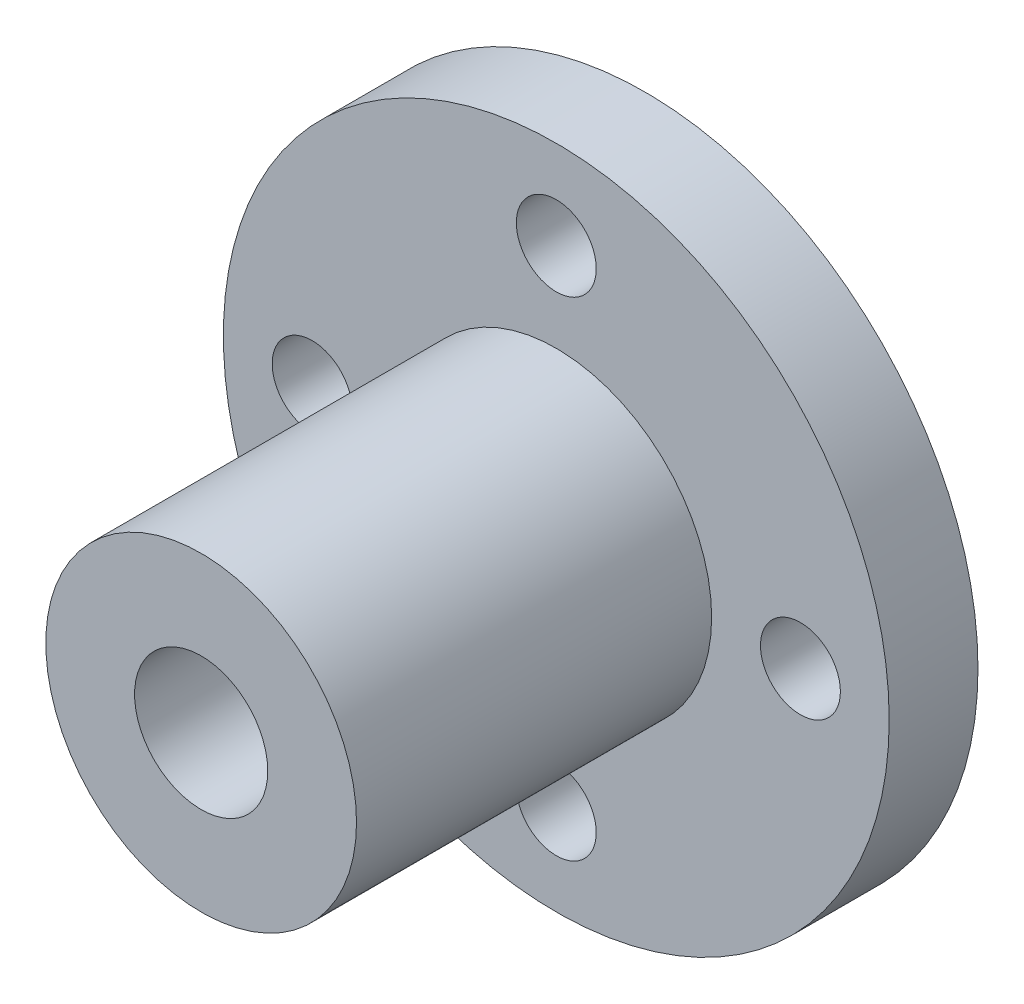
ISO-10303-21;
HEADER;
FILE_DESCRIPTION(('STEP AP214'),'2;1');
FILE_NAME('part.step','',(''),(''),'','','');
FILE_SCHEMA(('AUTOMOTIVE_DESIGN { 1 0 10303 214 1 1 1 1 }'));
ENDSEC;
DATA;
#1=APPLICATION_CONTEXT('core data for automotive mechanical design processes');
#2=APPLICATION_PROTOCOL_DEFINITION('international standard','automotive_design',2000,#1);
#3=PRODUCT_CONTEXT('',#1,'mechanical');
#4=PRODUCT('Part','Part','',(#3));
#5=PRODUCT_RELATED_PRODUCT_CATEGORY('part','',(#4));
#6=PRODUCT_DEFINITION_FORMATION('','',#4);
#7=PRODUCT_DEFINITION_CONTEXT('part definition',#1,'design');
#8=PRODUCT_DEFINITION('design','',#6,#7);
#9=PRODUCT_DEFINITION_SHAPE('','',#8);
#10=(LENGTH_UNIT() NAMED_UNIT(*) SI_UNIT(.MILLI.,.METRE.));
#11=(NAMED_UNIT(*) PLANE_ANGLE_UNIT() SI_UNIT($,.RADIAN.));
#12=(NAMED_UNIT(*) SI_UNIT($,.STERADIAN.) SOLID_ANGLE_UNIT());
#13=UNCERTAINTY_MEASURE_WITH_UNIT(LENGTH_MEASURE(1.E-05),#10,'distance_accuracy_value','');
#14=(GEOMETRIC_REPRESENTATION_CONTEXT(3) GLOBAL_UNCERTAINTY_ASSIGNED_CONTEXT((#13)) GLOBAL_UNIT_ASSIGNED_CONTEXT((#10,
#11,#12)) REPRESENTATION_CONTEXT('',''));
#15=CARTESIAN_POINT('',(0.,0.,0.));
#16=DIRECTION('',(0.,0.,1.));
#17=DIRECTION('',(1.,0.,0.));
#18=AXIS2_PLACEMENT_3D('',#15,#16,#17);
#19=CARTESIAN_POINT('',(0.,37.5,-50.));
#20=DIRECTION('',(0.,0.,1.));
#21=DIRECTION('',(1.,0.,0.));
#22=AXIS2_PLACEMENT_3D('',#19,#20,#21);
#23=PLANE('',#22);
#24=CARTESIAN_POINT('',(-27.5,2.88047377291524E-13,-50.));
#25=DIRECTION('',(0.,0.,1.));
#26=DIRECTION('',(1.,0.,0.));
#27=AXIS2_PLACEMENT_3D('',#24,#25,#26);
#28=CIRCLE('',#27,4.5);
#29=CARTESIAN_POINT('',(-23.,2.88047377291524E-13,-50.));
#30=VERTEX_POINT('',#29);
#31=EDGE_CURVE('E75',#30,#30,#28,.T.);
#32=ORIENTED_EDGE('',*,*,#31,.T.);
#33=EDGE_LOOP('',(#32));
#34=FACE_BOUND('',#33,.T.);
#35=CARTESIAN_POINT('',(-1.92031584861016E-13,-27.5,-50.));
#36=DIRECTION('',(0.,0.,1.));
#37=DIRECTION('',(1.,0.,0.));
#38=AXIS2_PLACEMENT_3D('',#35,#36,#37);
#39=CIRCLE('',#38,4.5);
#40=CARTESIAN_POINT('',(4.4999999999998,-27.5,-50.));
#41=VERTEX_POINT('',#40);
#42=EDGE_CURVE('E69',#41,#41,#39,.T.);
#43=ORIENTED_EDGE('',*,*,#42,.T.);
#44=EDGE_LOOP('',(#43));
#45=FACE_BOUND('',#44,.T.);
#46=CARTESIAN_POINT('',(27.5,0.,-50.));
#47=DIRECTION('',(0.,0.,1.));
#48=DIRECTION('',(1.,0.,0.));
#49=AXIS2_PLACEMENT_3D('',#46,#47,#48);
#50=CIRCLE('',#49,4.49999999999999);
#51=CARTESIAN_POINT('',(32.,0.,-50.));
#52=VERTEX_POINT('',#51);
#53=EDGE_CURVE('E63',#52,#52,#50,.T.);
#54=ORIENTED_EDGE('',*,*,#53,.T.);
#55=EDGE_LOOP('',(#54));
#56=FACE_BOUND('',#55,.T.);
#57=CARTESIAN_POINT('',(0.,27.5,-50.));
#58=DIRECTION('',(0.,0.,1.));
#59=DIRECTION('',(1.,0.,0.));
#60=AXIS2_PLACEMENT_3D('',#57,#58,#59);
#61=CIRCLE('',#60,4.5);
#62=CARTESIAN_POINT('',(4.5,27.5,-50.));
#63=VERTEX_POINT('',#62);
#64=EDGE_CURVE('E57',#63,#63,#61,.T.);
#65=ORIENTED_EDGE('',*,*,#64,.T.);
#66=EDGE_LOOP('',(#65));
#67=FACE_BOUND('',#66,.T.);
#68=CARTESIAN_POINT('',(0.,0.,-50.));
#69=DIRECTION('',(0.,0.,1.));
#70=DIRECTION('',(1.,0.,0.));
#71=AXIS2_PLACEMENT_3D('',#68,#69,#70);
#72=CIRCLE('',#71,37.5);
#73=CARTESIAN_POINT('',(37.5,0.,-50.));
#74=VERTEX_POINT('',#73);
#75=EDGE_CURVE('E54',#74,#74,#72,.T.);
#76=ORIENTED_EDGE('',*,*,#75,.F.);
#77=EDGE_LOOP('',(#76));
#78=FACE_BOUND('',#77,.T.);
#79=CARTESIAN_POINT('',(0.,0.,-50.));
#80=DIRECTION('',(0.,0.,1.));
#81=DIRECTION('',(1.,0.,0.));
#82=AXIS2_PLACEMENT_3D('',#79,#80,#81);
#83=CIRCLE('',#82,7.5);
#84=CARTESIAN_POINT('',(7.5,0.,-50.));
#85=VERTEX_POINT('',#84);
#86=EDGE_CURVE('E10',#85,#85,#83,.T.);
#87=ORIENTED_EDGE('',*,*,#86,.T.);
#88=EDGE_LOOP('',(#87));
#89=FACE_BOUND('',#88,.T.);
#90=ADVANCED_FACE('F32',(#34,#45,#56,#67,#78,#89),#23,.F.);
#91=CARTESIAN_POINT('',(0.,0.,0.));
#92=DIRECTION('',(0.,0.,1.));
#93=DIRECTION('',(1.,0.,0.));
#94=AXIS2_PLACEMENT_3D('',#91,#92,#93);
#95=CYLINDRICAL_SURFACE('',#94,7.5);
#96=ORIENTED_EDGE('',*,*,#86,.F.);
#97=EDGE_LOOP('',(#96));
#98=FACE_BOUND('',#97,.T.);
#99=CARTESIAN_POINT('',(0.,0.,0.));
#100=DIRECTION('',(0.,0.,1.));
#101=DIRECTION('',(1.,0.,0.));
#102=AXIS2_PLACEMENT_3D('',#99,#100,#101);
#103=CIRCLE('',#102,7.49999999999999);
#104=CARTESIAN_POINT('',(7.49999999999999,0.,0.));
#105=VERTEX_POINT('',#104);
#106=EDGE_CURVE('E38',#105,#105,#103,.T.);
#107=ORIENTED_EDGE('',*,*,#106,.T.);
#108=EDGE_LOOP('',(#107));
#109=FACE_BOUND('',#108,.T.);
#110=ADVANCED_FACE('F108',(#98,#109),#95,.F.);
#111=CARTESIAN_POINT('',(0.,7.49999999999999,0.));
#112=DIRECTION('',(0.,0.,-1.));
#113=DIRECTION('',(-1.,0.,0.));
#114=AXIS2_PLACEMENT_3D('',#111,#112,#113);
#115=PLANE('',#114);
#116=ORIENTED_EDGE('',*,*,#106,.F.);
#117=EDGE_LOOP('',(#116));
#118=FACE_BOUND('',#117,.T.);
#119=CARTESIAN_POINT('',(0.,0.,0.));
#120=DIRECTION('',(0.,0.,1.));
#121=DIRECTION('',(1.,0.,0.));
#122=AXIS2_PLACEMENT_3D('',#119,#120,#121);
#123=CIRCLE('',#122,17.5);
#124=CARTESIAN_POINT('',(17.5,0.,0.));
#125=VERTEX_POINT('',#124);
#126=EDGE_CURVE('E42',#125,#125,#123,.T.);
#127=ORIENTED_EDGE('',*,*,#126,.T.);
#128=EDGE_LOOP('',(#127));
#129=FACE_BOUND('',#128,.T.);
#130=ADVANCED_FACE('F113',(#118,#129),#115,.F.);
#131=CARTESIAN_POINT('',(0.,0.,0.));
#132=DIRECTION('',(0.,0.,1.));
#133=DIRECTION('',(1.,0.,0.));
#134=AXIS2_PLACEMENT_3D('',#131,#132,#133);
#135=CYLINDRICAL_SURFACE('',#134,17.5);
#136=ORIENTED_EDGE('',*,*,#126,.F.);
#137=EDGE_LOOP('',(#136));
#138=FACE_BOUND('',#137,.T.);
#139=CARTESIAN_POINT('',(0.,0.,-40.));
#140=DIRECTION('',(0.,0.,1.));
#141=DIRECTION('',(1.,0.,0.));
#142=AXIS2_PLACEMENT_3D('',#139,#140,#141);
#143=CIRCLE('',#142,17.5);
#144=CARTESIAN_POINT('',(17.5,0.,-40.));
#145=VERTEX_POINT('',#144);
#146=EDGE_CURVE('E46',#145,#145,#143,.T.);
#147=ORIENTED_EDGE('',*,*,#146,.T.);
#148=EDGE_LOOP('',(#147));
#149=FACE_BOUND('',#148,.T.);
#150=ADVANCED_FACE('F89',(#138,#149),#135,.T.);
#151=CARTESIAN_POINT('',(0.,17.5,-40.));
#152=DIRECTION('',(0.,0.,-1.));
#153=DIRECTION('',(-1.,0.,0.));
#154=AXIS2_PLACEMENT_3D('',#151,#152,#153);
#155=PLANE('',#154);
#156=CARTESIAN_POINT('',(-27.5,2.88047377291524E-13,-40.));
#157=DIRECTION('',(0.,0.,1.));
#158=DIRECTION('',(1.,0.,0.));
#159=AXIS2_PLACEMENT_3D('',#156,#157,#158);
#160=CIRCLE('',#159,4.5);
#161=CARTESIAN_POINT('',(-23.,2.88047377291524E-13,-40.));
#162=VERTEX_POINT('',#161);
#163=EDGE_CURVE('E78',#162,#162,#160,.T.);
#164=ORIENTED_EDGE('',*,*,#163,.F.);
#165=EDGE_LOOP('',(#164));
#166=FACE_BOUND('',#165,.T.);
#167=CARTESIAN_POINT('',(-1.92031584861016E-13,-27.5,-40.));
#168=DIRECTION('',(0.,0.,1.));
#169=DIRECTION('',(1.,0.,0.));
#170=AXIS2_PLACEMENT_3D('',#167,#168,#169);
#171=CIRCLE('',#170,4.5);
#172=CARTESIAN_POINT('',(4.4999999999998,-27.5,-40.));
#173=VERTEX_POINT('',#172);
#174=EDGE_CURVE('E72',#173,#173,#171,.T.);
#175=ORIENTED_EDGE('',*,*,#174,.F.);
#176=EDGE_LOOP('',(#175));
#177=FACE_BOUND('',#176,.T.);
#178=CARTESIAN_POINT('',(27.5,0.,-40.));
#179=DIRECTION('',(0.,0.,1.));
#180=DIRECTION('',(1.,0.,0.));
#181=AXIS2_PLACEMENT_3D('',#178,#179,#180);
#182=CIRCLE('',#181,4.5);
#183=CARTESIAN_POINT('',(32.,0.,-40.));
#184=VERTEX_POINT('',#183);
#185=EDGE_CURVE('E66',#184,#184,#182,.T.);
#186=ORIENTED_EDGE('',*,*,#185,.F.);
#187=EDGE_LOOP('',(#186));
#188=FACE_BOUND('',#187,.T.);
#189=CARTESIAN_POINT('',(0.,27.5,-40.));
#190=DIRECTION('',(0.,0.,1.));
#191=DIRECTION('',(1.,0.,0.));
#192=AXIS2_PLACEMENT_3D('',#189,#190,#191);
#193=CIRCLE('',#192,4.5);
#194=CARTESIAN_POINT('',(4.5,27.5,-40.));
#195=VERTEX_POINT('',#194);
#196=EDGE_CURVE('E60',#195,#195,#193,.T.);
#197=ORIENTED_EDGE('',*,*,#196,.F.);
#198=EDGE_LOOP('',(#197));
#199=FACE_BOUND('',#198,.T.);
#200=ORIENTED_EDGE('',*,*,#146,.F.);
#201=EDGE_LOOP('',(#200));
#202=FACE_BOUND('',#201,.T.);
#203=CARTESIAN_POINT('',(0.,0.,-40.));
#204=DIRECTION('',(0.,0.,1.));
#205=DIRECTION('',(1.,0.,0.));
#206=AXIS2_PLACEMENT_3D('',#203,#204,#205);
#207=CIRCLE('',#206,37.5);
#208=CARTESIAN_POINT('',(37.5,0.,-40.));
#209=VERTEX_POINT('',#208);
#210=EDGE_CURVE('E51',#209,#209,#207,.T.);
#211=ORIENTED_EDGE('',*,*,#210,.T.);
#212=EDGE_LOOP('',(#211));
#213=FACE_BOUND('',#212,.T.);
#214=ADVANCED_FACE('F85',(#166,#177,#188,#199,#202,#213),#155,.F.);
#215=CARTESIAN_POINT('',(0.,0.,0.));
#216=DIRECTION('',(0.,0.,1.));
#217=DIRECTION('',(1.,0.,0.));
#218=AXIS2_PLACEMENT_3D('',#215,#216,#217);
#219=CYLINDRICAL_SURFACE('',#218,37.5);
#220=ORIENTED_EDGE('',*,*,#210,.F.);
#221=EDGE_LOOP('',(#220));
#222=FACE_BOUND('',#221,.T.);
#223=ORIENTED_EDGE('',*,*,#75,.T.);
#224=EDGE_LOOP('',(#223));
#225=FACE_BOUND('',#224,.T.);
#226=ADVANCED_FACE('F88',(#222,#225),#219,.T.);
#227=CARTESIAN_POINT('',(0.,27.5,-40.));
#228=DIRECTION('',(0.,0.,1.));
#229=DIRECTION('',(1.,0.,0.));
#230=AXIS2_PLACEMENT_3D('',#227,#228,#229);
#231=CYLINDRICAL_SURFACE('',#230,4.5);
#232=ORIENTED_EDGE('',*,*,#196,.T.);
#233=EDGE_LOOP('',(#232));
#234=FACE_BOUND('',#233,.T.);
#235=ORIENTED_EDGE('',*,*,#64,.F.);
#236=EDGE_LOOP('',(#235));
#237=FACE_BOUND('',#236,.T.);
#238=ADVANCED_FACE('F103',(#234,#237),#231,.F.);
#239=CARTESIAN_POINT('',(27.5,0.,-40.));
#240=DIRECTION('',(0.,0.,1.));
#241=DIRECTION('',(1.,0.,0.));
#242=AXIS2_PLACEMENT_3D('',#239,#240,#241);
#243=CYLINDRICAL_SURFACE('',#242,4.49999999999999);
#244=ORIENTED_EDGE('',*,*,#185,.T.);
#245=EDGE_LOOP('',(#244));
#246=FACE_BOUND('',#245,.T.);
#247=ORIENTED_EDGE('',*,*,#53,.F.);
#248=EDGE_LOOP('',(#247));
#249=FACE_BOUND('',#248,.T.);
#250=ADVANCED_FACE('F124',(#246,#249),#243,.F.);
#251=CARTESIAN_POINT('',(-1.92031584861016E-13,-27.5,-40.));
#252=DIRECTION('',(0.,0.,1.));
#253=DIRECTION('',(1.,0.,0.));
#254=AXIS2_PLACEMENT_3D('',#251,#252,#253);
#255=CYLINDRICAL_SURFACE('',#254,4.5);
#256=ORIENTED_EDGE('',*,*,#174,.T.);
#257=EDGE_LOOP('',(#256));
#258=FACE_BOUND('',#257,.T.);
#259=ORIENTED_EDGE('',*,*,#42,.F.);
#260=EDGE_LOOP('',(#259));
#261=FACE_BOUND('',#260,.T.);
#262=ADVANCED_FACE('F130',(#258,#261),#255,.F.);
#263=CARTESIAN_POINT('',(-27.5,2.88047377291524E-13,-40.));
#264=DIRECTION('',(0.,0.,1.));
#265=DIRECTION('',(1.,0.,0.));
#266=AXIS2_PLACEMENT_3D('',#263,#264,#265);
#267=CYLINDRICAL_SURFACE('',#266,4.5);
#268=ORIENTED_EDGE('',*,*,#163,.T.);
#269=EDGE_LOOP('',(#268));
#270=FACE_BOUND('',#269,.T.);
#271=ORIENTED_EDGE('',*,*,#31,.F.);
#272=EDGE_LOOP('',(#271));
#273=FACE_BOUND('',#272,.T.);
#274=ADVANCED_FACE('F82',(#270,#273),#267,.F.);
#275=CLOSED_SHELL('',(#90,#110,#130,#150,#214,#226,#238,#250,#262,#274));
#276=MANIFOLD_SOLID_BREP('B2',#275);
#277=ADVANCED_BREP_SHAPE_REPRESENTATION('',(#18,#276),#14);
#278=SHAPE_DEFINITION_REPRESENTATION(#9,#277);
ENDSEC;
END-ISO-10303-21;
